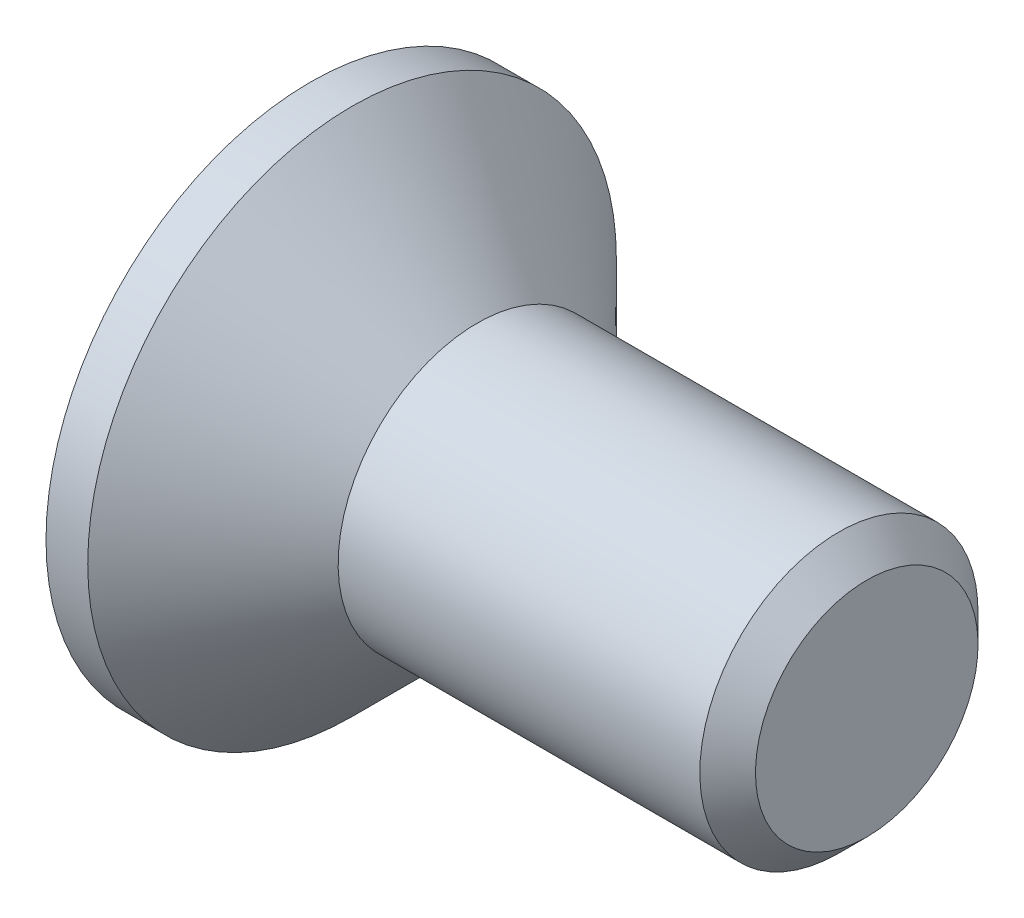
from build123d import *

# Parameters (mm, degrees)
CHAMFER1_SIZE      = 0.2
CUT_EXTRUDE1_DEPTH = 0.95


with BuildPart() as part:
    # Sketch1 → Revolve1 (revolve)
    with BuildSketch(Plane.XY, mode=Mode.PRIVATE) as revolve1_sk:
        Polygon((-1.2, 1.9), (-1.2, 0), (2.8, 0), (2.8, 1), (0, 1), (-0.9, 1.9), align=None)
    revolve(revolve1_sk.sketch.rotate(Axis((-1.2, 0, 0), (1, 0, 0)), 180), axis=Axis((-1.2, 0, 0), (1, 0, 0)))

    # Chamfer1
    chamfer1_edges = [part.edges().sort_by_distance(p)[0] for p in [
        (2.8, 1, 0),
    ]]
    chamfer(chamfer1_edges, length=CHAMFER1_SIZE)

    # Sketch2 → Cut-Extrude1 (cut)
    with BuildSketch(Plane.ZY.offset(1.2)):
        Polygon((-0.3, 1.175), (0.3, 1.175), (0.3, 0.3), (1.175, 0.3), (1.175, -0.3), (0.3, -0.3), (0.3, -1.175), (-0.3, -1.175), (-0.3, -0.3), (-1.175, -0.3), (-1.175, 0.3), (-0.3, 0.3), align=None)
    extrude(amount=-CUT_EXTRUDE1_DEPTH, mode=Mode.SUBTRACT)


solid = part.part
